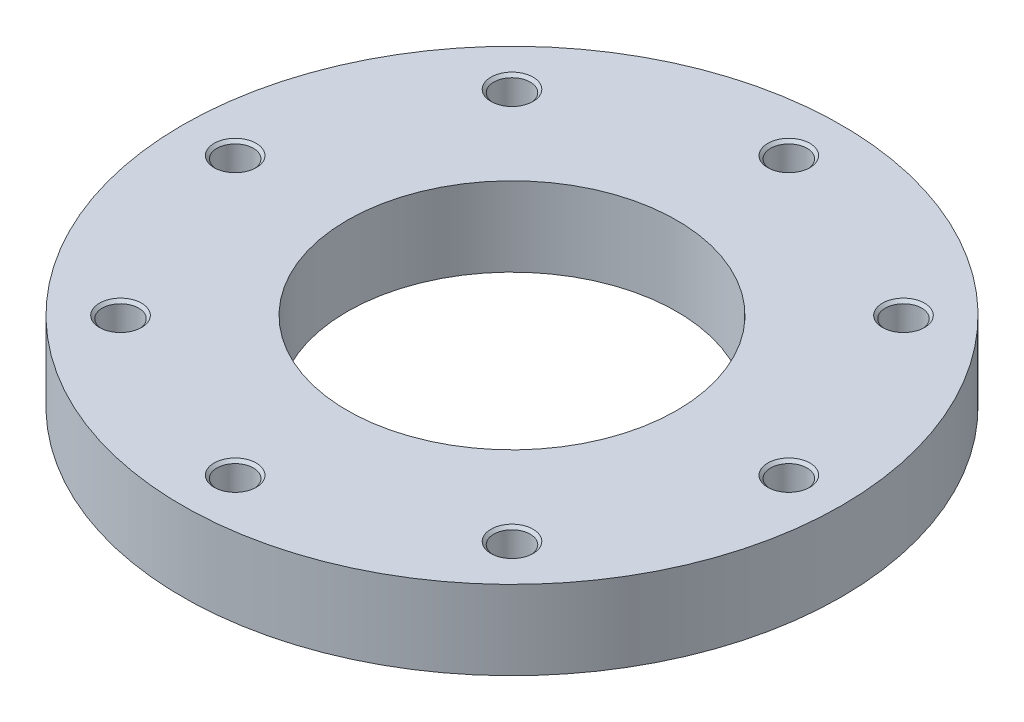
ISO-10303-21;
HEADER;
FILE_DESCRIPTION(('STEP AP214'),'2;1');
FILE_NAME('part.step','',(''),(''),'','','');
FILE_SCHEMA(('AUTOMOTIVE_DESIGN { 1 0 10303 214 1 1 1 1 }'));
ENDSEC;
DATA;
#1=APPLICATION_CONTEXT('core data for automotive mechanical design processes');
#2=APPLICATION_PROTOCOL_DEFINITION('international standard','automotive_design',2000,#1);
#3=PRODUCT_CONTEXT('',#1,'mechanical');
#4=PRODUCT('Part','Part','',(#3));
#5=PRODUCT_RELATED_PRODUCT_CATEGORY('part','',(#4));
#6=PRODUCT_DEFINITION_FORMATION('','',#4);
#7=PRODUCT_DEFINITION_CONTEXT('part definition',#1,'design');
#8=PRODUCT_DEFINITION('design','',#6,#7);
#9=PRODUCT_DEFINITION_SHAPE('','',#8);
#10=(LENGTH_UNIT() NAMED_UNIT(*) SI_UNIT(.MILLI.,.METRE.));
#11=(NAMED_UNIT(*) PLANE_ANGLE_UNIT() SI_UNIT($,.RADIAN.));
#12=(NAMED_UNIT(*) SI_UNIT($,.STERADIAN.) SOLID_ANGLE_UNIT());
#13=UNCERTAINTY_MEASURE_WITH_UNIT(LENGTH_MEASURE(1.E-05),#10,'distance_accuracy_value','');
#14=(GEOMETRIC_REPRESENTATION_CONTEXT(3) GLOBAL_UNCERTAINTY_ASSIGNED_CONTEXT((#13)) GLOBAL_UNIT_ASSIGNED_CONTEXT((#10,
#11,#12)) REPRESENTATION_CONTEXT('',''));
#15=CARTESIAN_POINT('',(0.,0.,0.));
#16=DIRECTION('',(0.,0.,1.));
#17=DIRECTION('',(1.,0.,0.));
#18=AXIS2_PLACEMENT_3D('',#15,#16,#17);
#19=CARTESIAN_POINT('',(0.,15.,0.));
#20=DIRECTION('',(0.,-1.,0.));
#21=DIRECTION('',(1.,0.,0.));
#22=AXIS2_PLACEMENT_3D('',#19,#20,#21);
#23=CYLINDRICAL_SURFACE('',#22,125.);
#24=CARTESIAN_POINT('',(0.,0.,0.));
#25=DIRECTION('',(0.,1.,0.));
#26=DIRECTION('',(1.,0.,0.));
#27=AXIS2_PLACEMENT_3D('',#24,#25,#26);
#28=CIRCLE('',#27,125.);
#29=CARTESIAN_POINT('',(125.,0.,0.));
#30=VERTEX_POINT('',#29);
#31=EDGE_CURVE('E9',#30,#30,#28,.T.);
#32=ORIENTED_EDGE('',*,*,#31,.T.);
#33=EDGE_LOOP('',(#32));
#34=FACE_BOUND('',#33,.T.);
#35=CARTESIAN_POINT('',(0.,30.,0.));
#36=DIRECTION('',(0.,1.,0.));
#37=DIRECTION('',(1.,0.,0.));
#38=AXIS2_PLACEMENT_3D('',#35,#36,#37);
#39=CIRCLE('',#38,125.);
#40=CARTESIAN_POINT('',(125.,30.,0.));
#41=VERTEX_POINT('',#40);
#42=EDGE_CURVE('E307',#41,#41,#39,.T.);
#43=ORIENTED_EDGE('',*,*,#42,.F.);
#44=EDGE_LOOP('',(#43));
#45=FACE_BOUND('',#44,.T.);
#46=ADVANCED_FACE('F15',(#34,#45),#23,.T.);
#47=CARTESIAN_POINT('',(93.75,0.,0.));
#48=DIRECTION('',(0.,-1.,0.));
#49=DIRECTION('',(-1.,0.,0.));
#50=AXIS2_PLACEMENT_3D('',#47,#48,#49);
#51=PLANE('',#50);
#52=CARTESIAN_POINT('',(0.,0.,0.));
#53=DIRECTION('',(0.,1.,0.));
#54=DIRECTION('',(1.,0.,0.));
#55=AXIS2_PLACEMENT_3D('',#52,#53,#54);
#56=CIRCLE('',#55,62.5);
#57=CARTESIAN_POINT('',(62.5,0.,0.));
#58=VERTEX_POINT('',#57);
#59=EDGE_CURVE('E22',#58,#58,#56,.T.);
#60=ORIENTED_EDGE('',*,*,#59,.T.);
#61=EDGE_LOOP('',(#60));
#62=FACE_BOUND('',#61,.T.);
#63=ORIENTED_EDGE('',*,*,#31,.F.);
#64=EDGE_LOOP('',(#63));
#65=FACE_BOUND('',#64,.T.);
#66=ADVANCED_FACE('F313',(#62,#65),#51,.T.);
#67=CARTESIAN_POINT('',(0.,15.,0.));
#68=DIRECTION('',(0.,-1.,0.));
#69=DIRECTION('',(1.,0.,0.));
#70=AXIS2_PLACEMENT_3D('',#67,#68,#69);
#71=CYLINDRICAL_SURFACE('',#70,62.5);
#72=CARTESIAN_POINT('',(0.,30.,0.));
#73=DIRECTION('',(0.,1.,0.));
#74=DIRECTION('',(1.,0.,0.));
#75=AXIS2_PLACEMENT_3D('',#72,#73,#74);
#76=CIRCLE('',#75,62.5);
#77=CARTESIAN_POINT('',(62.5,30.,0.));
#78=VERTEX_POINT('',#77);
#79=EDGE_CURVE('E283',#78,#78,#76,.T.);
#80=ORIENTED_EDGE('',*,*,#79,.T.);
#81=EDGE_LOOP('',(#80));
#82=FACE_BOUND('',#81,.T.);
#83=ORIENTED_EDGE('',*,*,#59,.F.);
#84=EDGE_LOOP('',(#83));
#85=FACE_BOUND('',#84,.T.);
#86=ADVANCED_FACE('F318',(#82,#85),#71,.F.);
#87=CARTESIAN_POINT('',(93.75,30.,0.));
#88=DIRECTION('',(0.,1.,0.));
#89=DIRECTION('',(1.,0.,0.));
#90=AXIS2_PLACEMENT_3D('',#87,#88,#89);
#91=PLANE('',#90);
#92=ORIENTED_EDGE('',*,*,#42,.T.);
#93=EDGE_LOOP('',(#92));
#94=FACE_BOUND('',#93,.T.);
#95=ORIENTED_EDGE('',*,*,#79,.F.);
#96=EDGE_LOOP('',(#95));
#97=FACE_BOUND('',#96,.T.);
#98=CARTESIAN_POINT('',(105.,30.,0.));
#99=DIRECTION('',(0.,-1.,0.));
#100=DIRECTION('',(1.,0.,0.));
#101=AXIS2_PLACEMENT_3D('',#98,#99,#100);
#102=CIRCLE('',#101,8.);
#103=CARTESIAN_POINT('',(113.,30.,0.));
#104=VERTEX_POINT('',#103);
#105=EDGE_CURVE('E274',#104,#104,#102,.T.);
#106=ORIENTED_EDGE('',*,*,#105,.T.);
#107=EDGE_LOOP('',(#106));
#108=FACE_BOUND('',#107,.T.);
#109=CARTESIAN_POINT('',(74.2462120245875,30.,-74.2462120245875));
#110=DIRECTION('',(0.,-1.,0.));
#111=DIRECTION('',(0.707106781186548,0.,-0.707106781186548));
#112=AXIS2_PLACEMENT_3D('',#109,#110,#111);
#113=CIRCLE('',#112,8.);
#114=CARTESIAN_POINT('',(79.9030662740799,30.,-79.9030662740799));
#115=VERTEX_POINT('',#114);
#116=EDGE_CURVE('E219',#115,#115,#113,.T.);
#117=ORIENTED_EDGE('',*,*,#116,.T.);
#118=EDGE_LOOP('',(#117));
#119=FACE_BOUND('',#118,.T.);
#120=CARTESIAN_POINT('',(0.,30.,-105.));
#121=DIRECTION('',(0.,-1.,0.));
#122=DIRECTION('',(0.,0.,-1.));
#123=AXIS2_PLACEMENT_3D('',#120,#121,#122);
#124=CIRCLE('',#123,8.);
#125=CARTESIAN_POINT('',(0.,30.,-113.));
#126=VERTEX_POINT('',#125);
#127=EDGE_CURVE('E245',#126,#126,#124,.T.);
#128=ORIENTED_EDGE('',*,*,#127,.T.);
#129=EDGE_LOOP('',(#128));
#130=FACE_BOUND('',#129,.T.);
#131=CARTESIAN_POINT('',(-74.2462120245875,30.,-74.2462120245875));
#132=DIRECTION('',(0.,-1.,0.));
#133=DIRECTION('',(-0.707106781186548,0.,-0.707106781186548));
#134=AXIS2_PLACEMENT_3D('',#131,#132,#133);
#135=CIRCLE('',#134,8.);
#136=CARTESIAN_POINT('',(-79.9030662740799,30.,-79.9030662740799));
#137=VERTEX_POINT('',#136);
#138=EDGE_CURVE('E273',#137,#137,#135,.T.);
#139=ORIENTED_EDGE('',*,*,#138,.T.);
#140=EDGE_LOOP('',(#139));
#141=FACE_BOUND('',#140,.T.);
#142=CARTESIAN_POINT('',(-105.,30.,0.));
#143=DIRECTION('',(0.,-1.,0.));
#144=DIRECTION('',(-1.,0.,0.));
#145=AXIS2_PLACEMENT_3D('',#142,#143,#144);
#146=CIRCLE('',#145,8.);
#147=CARTESIAN_POINT('',(-113.,30.,0.));
#148=VERTEX_POINT('',#147);
#149=EDGE_CURVE('E257',#148,#148,#146,.T.);
#150=ORIENTED_EDGE('',*,*,#149,.T.);
#151=EDGE_LOOP('',(#150));
#152=FACE_BOUND('',#151,.T.);
#153=CARTESIAN_POINT('',(-74.2462120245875,30.,74.2462120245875));
#154=DIRECTION('',(0.,-1.,0.));
#155=DIRECTION('',(-0.707106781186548,0.,0.707106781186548));
#156=AXIS2_PLACEMENT_3D('',#153,#154,#155);
#157=CIRCLE('',#156,8.);
#158=CARTESIAN_POINT('',(-79.9030662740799,30.,79.9030662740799));
#159=VERTEX_POINT('',#158);
#160=EDGE_CURVE('E228',#159,#159,#157,.T.);
#161=ORIENTED_EDGE('',*,*,#160,.T.);
#162=EDGE_LOOP('',(#161));
#163=FACE_BOUND('',#162,.T.);
#164=CARTESIAN_POINT('',(0.,30.,105.));
#165=DIRECTION('',(0.,-1.,0.));
#166=DIRECTION('',(0.,0.,1.));
#167=AXIS2_PLACEMENT_3D('',#164,#165,#166);
#168=CIRCLE('',#167,8.);
#169=CARTESIAN_POINT('',(0.,30.,113.));
#170=VERTEX_POINT('',#169);
#171=EDGE_CURVE('E205',#170,#170,#168,.T.);
#172=ORIENTED_EDGE('',*,*,#171,.T.);
#173=EDGE_LOOP('',(#172));
#174=FACE_BOUND('',#173,.T.);
#175=CARTESIAN_POINT('',(74.2462120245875,30.,74.2462120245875));
#176=DIRECTION('',(0.,-1.,0.));
#177=DIRECTION('',(0.707106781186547,0.,0.707106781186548));
#178=AXIS2_PLACEMENT_3D('',#175,#176,#177);
#179=CIRCLE('',#178,8.);
#180=CARTESIAN_POINT('',(79.9030662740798,30.,79.9030662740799));
#181=VERTEX_POINT('',#180);
#182=EDGE_CURVE('E225',#181,#181,#179,.T.);
#183=ORIENTED_EDGE('',*,*,#182,.T.);
#184=EDGE_LOOP('',(#183));
#185=FACE_BOUND('',#184,.T.);
#186=ADVANCED_FACE('F206',(#94,#97,#108,#119,#130,#141,#152,#163,#174,#185),#91,.T.);
#187=CARTESIAN_POINT('',(105.,5.00308975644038,0.));
#188=DIRECTION('',(0.,1.,0.));
#189=DIRECTION('',(1.,0.,0.));
#190=AXIS2_PLACEMENT_3D('',#187,#188,#189);
#191=CONICAL_SURFACE('',#190,3.45875,1.0471975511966);
#192=CARTESIAN_POINT('',(105.,7.,0.));
#193=DIRECTION('',(0.,-1.,0.));
#194=DIRECTION('',(1.,0.,0.));
#195=AXIS2_PLACEMENT_3D('',#192,#193,#194);
#196=CIRCLE('',#195,6.9175);
#197=CARTESIAN_POINT('',(111.9175,7.,0.));
#198=VERTEX_POINT('',#197);
#199=EDGE_CURVE('E281',#198,#198,#196,.T.);
#200=ORIENTED_EDGE('',*,*,#199,.F.);
#201=EDGE_LOOP('',(#200));
#202=FACE_BOUND('',#201,.T.);
#203=CARTESIAN_POINT('',(105.,3.00617951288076,0.));
#204=VERTEX_POINT('',#203);
#205=VERTEX_LOOP('',#204);
#206=FACE_BOUND('',#205,.T.);
#207=ADVANCED_FACE('F328',(#202,#206),#191,.F.);
#208=CARTESIAN_POINT('',(105.,9.95875,0.));
#209=DIRECTION('',(0.,1.,0.));
#210=DIRECTION('',(1.,0.,0.));
#211=AXIS2_PLACEMENT_3D('',#208,#209,#210);
#212=CYLINDRICAL_SURFACE('',#211,6.9175);
#213=CARTESIAN_POINT('',(105.,12.9175,0.));
#214=DIRECTION('',(0.,-1.,0.));
#215=DIRECTION('',(1.,0.,0.));
#216=AXIS2_PLACEMENT_3D('',#213,#214,#215);
#217=CIRCLE('',#216,6.9175);
#218=CARTESIAN_POINT('',(111.9175,12.9175,0.));
#219=VERTEX_POINT('',#218);
#220=EDGE_CURVE('E284',#219,#219,#217,.T.);
#221=ORIENTED_EDGE('',*,*,#220,.F.);
#222=EDGE_LOOP('',(#221));
#223=FACE_BOUND('',#222,.T.);
#224=ORIENTED_EDGE('',*,*,#199,.T.);
#225=EDGE_LOOP('',(#224));
#226=FACE_BOUND('',#225,.T.);
#227=ADVANCED_FACE('F331',(#223,#226),#212,.F.);
#228=CARTESIAN_POINT('',(105.,13.45875,0.));
#229=DIRECTION('',(0.,1.,0.));
#230=DIRECTION('',(1.,0.,0.));
#231=AXIS2_PLACEMENT_3D('',#228,#229,#230);
#232=CONICAL_SURFACE('',#231,7.45875,0.785398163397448);
#233=CARTESIAN_POINT('',(105.,14.,0.));
#234=DIRECTION('',(0.,-1.,0.));
#235=DIRECTION('',(1.,0.,0.));
#236=AXIS2_PLACEMENT_3D('',#233,#234,#235);
#237=CIRCLE('',#236,8.);
#238=CARTESIAN_POINT('',(113.,14.,0.));
#239=VERTEX_POINT('',#238);
#240=EDGE_CURVE('E303',#239,#239,#237,.T.);
#241=ORIENTED_EDGE('',*,*,#240,.F.);
#242=EDGE_LOOP('',(#241));
#243=FACE_BOUND('',#242,.T.);
#244=ORIENTED_EDGE('',*,*,#220,.T.);
#245=EDGE_LOOP('',(#244));
#246=FACE_BOUND('',#245,.T.);
#247=ADVANCED_FACE('F333',(#243,#246),#232,.F.);
#248=CARTESIAN_POINT('',(112.45875,14.,0.));
#249=DIRECTION('',(0.,1.,0.));
#250=DIRECTION('',(-1.,0.,0.));
#251=AXIS2_PLACEMENT_3D('',#248,#249,#250);
#252=PLANE('',#251);
#253=CARTESIAN_POINT('',(105.,14.,0.));
#254=DIRECTION('',(0.,-1.,0.));
#255=DIRECTION('',(1.,0.,0.));
#256=AXIS2_PLACEMENT_3D('',#253,#254,#255);
#257=CIRCLE('',#256,6.9175);
#258=CARTESIAN_POINT('',(111.9175,14.,0.));
#259=VERTEX_POINT('',#258);
#260=EDGE_CURVE('E276',#259,#259,#257,.T.);
#261=ORIENTED_EDGE('',*,*,#260,.F.);
#262=EDGE_LOOP('',(#261));
#263=FACE_BOUND('',#262,.T.);
#264=ORIENTED_EDGE('',*,*,#240,.T.);
#265=EDGE_LOOP('',(#264));
#266=FACE_BOUND('',#265,.T.);
#267=ADVANCED_FACE('F336',(#263,#266),#252,.F.);
#268=CARTESIAN_POINT('',(105.,21.45875,0.));
#269=DIRECTION('',(0.,1.,0.));
#270=DIRECTION('',(1.,0.,0.));
#271=AXIS2_PLACEMENT_3D('',#268,#269,#270);
#272=CYLINDRICAL_SURFACE('',#271,6.9175);
#273=CARTESIAN_POINT('',(105.,28.9175,0.));
#274=DIRECTION('',(0.,-1.,0.));
#275=DIRECTION('',(1.,0.,0.));
#276=AXIS2_PLACEMENT_3D('',#273,#274,#275);
#277=CIRCLE('',#276,6.9175);
#278=CARTESIAN_POINT('',(111.9175,28.9175,0.));
#279=VERTEX_POINT('',#278);
#280=EDGE_CURVE('E268',#279,#279,#277,.T.);
#281=ORIENTED_EDGE('',*,*,#280,.F.);
#282=EDGE_LOOP('',(#281));
#283=FACE_BOUND('',#282,.T.);
#284=ORIENTED_EDGE('',*,*,#260,.T.);
#285=EDGE_LOOP('',(#284));
#286=FACE_BOUND('',#285,.T.);
#287=ADVANCED_FACE('F340',(#283,#286),#272,.F.);
#288=CARTESIAN_POINT('',(105.,29.45875,0.));
#289=DIRECTION('',(0.,1.,0.));
#290=DIRECTION('',(1.,0.,0.));
#291=AXIS2_PLACEMENT_3D('',#288,#289,#290);
#292=CONICAL_SURFACE('',#291,7.45875,0.785398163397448);
#293=ORIENTED_EDGE('',*,*,#105,.F.);
#294=EDGE_LOOP('',(#293));
#295=FACE_BOUND('',#294,.T.);
#296=ORIENTED_EDGE('',*,*,#280,.T.);
#297=EDGE_LOOP('',(#296));
#298=FACE_BOUND('',#297,.T.);
#299=ADVANCED_FACE('F344',(#295,#298),#292,.F.);
#300=CARTESIAN_POINT('',(74.2462120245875,5.00308975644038,-74.2462120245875));
#301=DIRECTION('',(0.,1.,0.));
#302=DIRECTION('',(0.707106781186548,0.,-0.707106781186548));
#303=AXIS2_PLACEMENT_3D('',#300,#301,#302);
#304=CONICAL_SURFACE('',#303,3.45875,1.0471975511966);
#305=CARTESIAN_POINT('',(74.2462120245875,7.,-74.2462120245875));
#306=DIRECTION('',(0.,-1.,0.));
#307=DIRECTION('',(0.707106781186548,0.,-0.707106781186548));
#308=AXIS2_PLACEMENT_3D('',#305,#306,#307);
#309=CIRCLE('',#308,6.9175);
#310=CARTESIAN_POINT('',(79.1376231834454,7.,-79.1376231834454));
#311=VERTEX_POINT('',#310);
#312=EDGE_CURVE('E266',#311,#311,#309,.T.);
#313=ORIENTED_EDGE('',*,*,#312,.F.);
#314=EDGE_LOOP('',(#313));
#315=FACE_BOUND('',#314,.T.);
#316=CARTESIAN_POINT('',(74.2462120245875,3.00617951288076,-74.2462120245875));
#317=VERTEX_POINT('',#316);
#318=VERTEX_LOOP('',#317);
#319=FACE_BOUND('',#318,.T.);
#320=ADVANCED_FACE('F346',(#315,#319),#304,.F.);
#321=CARTESIAN_POINT('',(74.2462120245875,9.95875,-74.2462120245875));
#322=DIRECTION('',(0.,1.,0.));
#323=DIRECTION('',(0.707106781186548,0.,-0.707106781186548));
#324=AXIS2_PLACEMENT_3D('',#321,#322,#323);
#325=CYLINDRICAL_SURFACE('',#324,6.9175);
#326=CARTESIAN_POINT('',(74.2462120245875,12.9175,-74.2462120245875));
#327=DIRECTION('',(0.,-1.,0.));
#328=DIRECTION('',(0.707106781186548,0.,-0.707106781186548));
#329=AXIS2_PLACEMENT_3D('',#326,#327,#328);
#330=CIRCLE('',#329,6.9175);
#331=CARTESIAN_POINT('',(79.1376231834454,12.9175,-79.1376231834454));
#332=VERTEX_POINT('',#331);
#333=EDGE_CURVE('E269',#332,#332,#330,.T.);
#334=ORIENTED_EDGE('',*,*,#333,.F.);
#335=EDGE_LOOP('',(#334));
#336=FACE_BOUND('',#335,.T.);
#337=ORIENTED_EDGE('',*,*,#312,.T.);
#338=EDGE_LOOP('',(#337));
#339=FACE_BOUND('',#338,.T.);
#340=ADVANCED_FACE('F349',(#336,#339),#325,.F.);
#341=CARTESIAN_POINT('',(74.2462120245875,13.45875,-74.2462120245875));
#342=DIRECTION('',(0.,1.,0.));
#343=DIRECTION('',(0.707106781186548,0.,-0.707106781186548));
#344=AXIS2_PLACEMENT_3D('',#341,#342,#343);
#345=CONICAL_SURFACE('',#344,7.45875,0.785398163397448);
#346=CARTESIAN_POINT('',(74.2462120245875,14.,-74.2462120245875));
#347=DIRECTION('',(0.,-1.,0.));
#348=DIRECTION('',(0.707106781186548,0.,-0.707106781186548));
#349=AXIS2_PLACEMENT_3D('',#346,#347,#348);
#350=CIRCLE('',#349,8.);
#351=CARTESIAN_POINT('',(79.9030662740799,14.,-79.9030662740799));
#352=VERTEX_POINT('',#351);
#353=EDGE_CURVE('E298',#352,#352,#350,.T.);
#354=ORIENTED_EDGE('',*,*,#353,.F.);
#355=EDGE_LOOP('',(#354));
#356=FACE_BOUND('',#355,.T.);
#357=ORIENTED_EDGE('',*,*,#333,.T.);
#358=EDGE_LOOP('',(#357));
#359=FACE_BOUND('',#358,.T.);
#360=ADVANCED_FACE('F353',(#356,#359),#345,.F.);
#361=CARTESIAN_POINT('',(79.5203447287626,14.,-79.5203447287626));
#362=DIRECTION('',(0.,1.,0.));
#363=DIRECTION('',(-0.707106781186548,0.,0.707106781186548));
#364=AXIS2_PLACEMENT_3D('',#361,#362,#363);
#365=PLANE('',#364);
#366=CARTESIAN_POINT('',(74.2462120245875,14.,-74.2462120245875));
#367=DIRECTION('',(0.,-1.,0.));
#368=DIRECTION('',(0.707106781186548,0.,-0.707106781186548));
#369=AXIS2_PLACEMENT_3D('',#366,#367,#368);
#370=CIRCLE('',#369,6.9175);
#371=CARTESIAN_POINT('',(79.1376231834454,14.,-79.1376231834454));
#372=VERTEX_POINT('',#371);
#373=EDGE_CURVE('E221',#372,#372,#370,.T.);
#374=ORIENTED_EDGE('',*,*,#373,.F.);
#375=EDGE_LOOP('',(#374));
#376=FACE_BOUND('',#375,.T.);
#377=ORIENTED_EDGE('',*,*,#353,.T.);
#378=EDGE_LOOP('',(#377));
#379=FACE_BOUND('',#378,.T.);
#380=ADVANCED_FACE('F357',(#376,#379),#365,.F.);
#381=CARTESIAN_POINT('',(74.2462120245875,21.45875,-74.2462120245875));
#382=DIRECTION('',(0.,1.,0.));
#383=DIRECTION('',(0.707106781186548,0.,-0.707106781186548));
#384=AXIS2_PLACEMENT_3D('',#381,#382,#383);
#385=CYLINDRICAL_SURFACE('',#384,6.9175);
#386=CARTESIAN_POINT('',(74.2462120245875,28.9175,-74.2462120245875));
#387=DIRECTION('',(0.,-1.,0.));
#388=DIRECTION('',(0.707106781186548,0.,-0.707106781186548));
#389=AXIS2_PLACEMENT_3D('',#386,#387,#388);
#390=CIRCLE('',#389,6.9175);
#391=CARTESIAN_POINT('',(79.1376231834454,28.9175,-79.1376231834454));
#392=VERTEX_POINT('',#391);
#393=EDGE_CURVE('E222',#392,#392,#390,.T.);
#394=ORIENTED_EDGE('',*,*,#393,.F.);
#395=EDGE_LOOP('',(#394));
#396=FACE_BOUND('',#395,.T.);
#397=ORIENTED_EDGE('',*,*,#373,.T.);
#398=EDGE_LOOP('',(#397));
#399=FACE_BOUND('',#398,.T.);
#400=ADVANCED_FACE('F361',(#396,#399),#385,.F.);
#401=CARTESIAN_POINT('',(74.2462120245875,29.45875,-74.2462120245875));
#402=DIRECTION('',(0.,1.,0.));
#403=DIRECTION('',(0.707106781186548,0.,-0.707106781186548));
#404=AXIS2_PLACEMENT_3D('',#401,#402,#403);
#405=CONICAL_SURFACE('',#404,7.45875,0.785398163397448);
#406=ORIENTED_EDGE('',*,*,#116,.F.);
#407=EDGE_LOOP('',(#406));
#408=FACE_BOUND('',#407,.T.);
#409=ORIENTED_EDGE('',*,*,#393,.T.);
#410=EDGE_LOOP('',(#409));
#411=FACE_BOUND('',#410,.T.);
#412=ADVANCED_FACE('F363',(#408,#411),#405,.F.);
#413=CARTESIAN_POINT('',(0.,5.00308975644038,-105.));
#414=DIRECTION('',(0.,1.,0.));
#415=DIRECTION('',(0.,0.,-1.));
#416=AXIS2_PLACEMENT_3D('',#413,#414,#415);
#417=CONICAL_SURFACE('',#416,3.45875,1.0471975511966);
#418=CARTESIAN_POINT('',(0.,7.,-105.));
#419=DIRECTION('',(0.,-1.,0.));
#420=DIRECTION('',(0.,0.,-1.));
#421=AXIS2_PLACEMENT_3D('',#418,#419,#420);
#422=CIRCLE('',#421,6.9175);
#423=CARTESIAN_POINT('',(0.,7.,-111.9175));
#424=VERTEX_POINT('',#423);
#425=EDGE_CURVE('E255',#424,#424,#422,.T.);
#426=ORIENTED_EDGE('',*,*,#425,.F.);
#427=EDGE_LOOP('',(#426));
#428=FACE_BOUND('',#427,.T.);
#429=CARTESIAN_POINT('',(0.,3.00617951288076,-105.));
#430=VERTEX_POINT('',#429);
#431=VERTEX_LOOP('',#430);
#432=FACE_BOUND('',#431,.T.);
#433=ADVANCED_FACE('F366',(#428,#432),#417,.F.);
#434=CARTESIAN_POINT('',(0.,9.95875,-105.));
#435=DIRECTION('',(0.,1.,0.));
#436=DIRECTION('',(0.,0.,-1.));
#437=AXIS2_PLACEMENT_3D('',#434,#435,#436);
#438=CYLINDRICAL_SURFACE('',#437,6.9175);
#439=CARTESIAN_POINT('',(0.,12.9175,-105.));
#440=DIRECTION('',(0.,-1.,0.));
#441=DIRECTION('',(0.,0.,-1.));
#442=AXIS2_PLACEMENT_3D('',#439,#440,#441);
#443=CIRCLE('',#442,6.9175);
#444=CARTESIAN_POINT('',(0.,12.9175,-111.9175));
#445=VERTEX_POINT('',#444);
#446=EDGE_CURVE('E294',#445,#445,#443,.T.);
#447=ORIENTED_EDGE('',*,*,#446,.F.);
#448=EDGE_LOOP('',(#447));
#449=FACE_BOUND('',#448,.T.);
#450=ORIENTED_EDGE('',*,*,#425,.T.);
#451=EDGE_LOOP('',(#450));
#452=FACE_BOUND('',#451,.T.);
#453=ADVANCED_FACE('F370',(#449,#452),#438,.F.);
#454=CARTESIAN_POINT('',(0.,13.45875,-105.));
#455=DIRECTION('',(0.,1.,0.));
#456=DIRECTION('',(0.,0.,-1.));
#457=AXIS2_PLACEMENT_3D('',#454,#455,#456);
#458=CONICAL_SURFACE('',#457,7.45875,0.785398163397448);
#459=CARTESIAN_POINT('',(0.,14.,-105.));
#460=DIRECTION('',(0.,-1.,0.));
#461=DIRECTION('',(0.,0.,-1.));
#462=AXIS2_PLACEMENT_3D('',#459,#460,#461);
#463=CIRCLE('',#462,8.);
#464=CARTESIAN_POINT('',(0.,14.,-113.));
#465=VERTEX_POINT('',#464);
#466=EDGE_CURVE('E244',#465,#465,#463,.T.);
#467=ORIENTED_EDGE('',*,*,#466,.F.);
#468=EDGE_LOOP('',(#467));
#469=FACE_BOUND('',#468,.T.);
#470=ORIENTED_EDGE('',*,*,#446,.T.);
#471=EDGE_LOOP('',(#470));
#472=FACE_BOUND('',#471,.T.);
#473=ADVANCED_FACE('F374',(#469,#472),#458,.F.);
#474=CARTESIAN_POINT('',(0.,14.,-112.45875));
#475=DIRECTION('',(0.,1.,0.));
#476=DIRECTION('',(0.,0.,1.));
#477=AXIS2_PLACEMENT_3D('',#474,#475,#476);
#478=PLANE('',#477);
#479=CARTESIAN_POINT('',(0.,14.,-105.));
#480=DIRECTION('',(0.,-1.,0.));
#481=DIRECTION('',(0.,0.,-1.));
#482=AXIS2_PLACEMENT_3D('',#479,#480,#481);
#483=CIRCLE('',#482,6.9175);
#484=CARTESIAN_POINT('',(0.,14.,-111.9175));
#485=VERTEX_POINT('',#484);
#486=EDGE_CURVE('E242',#485,#485,#483,.T.);
#487=ORIENTED_EDGE('',*,*,#486,.F.);
#488=EDGE_LOOP('',(#487));
#489=FACE_BOUND('',#488,.T.);
#490=ORIENTED_EDGE('',*,*,#466,.T.);
#491=EDGE_LOOP('',(#490));
#492=FACE_BOUND('',#491,.T.);
#493=ADVANCED_FACE('F376',(#489,#492),#478,.F.);
#494=CARTESIAN_POINT('',(0.,21.45875,-105.));
#495=DIRECTION('',(0.,1.,0.));
#496=DIRECTION('',(0.,0.,-1.));
#497=AXIS2_PLACEMENT_3D('',#494,#495,#496);
#498=CYLINDRICAL_SURFACE('',#497,6.9175);
#499=CARTESIAN_POINT('',(0.,28.9175,-105.));
#500=DIRECTION('',(0.,-1.,0.));
#501=DIRECTION('',(0.,0.,-1.));
#502=AXIS2_PLACEMENT_3D('',#499,#500,#501);
#503=CIRCLE('',#502,6.9175);
#504=CARTESIAN_POINT('',(0.,28.9175,-111.9175));
#505=VERTEX_POINT('',#504);
#506=EDGE_CURVE('E290',#505,#505,#503,.T.);
#507=ORIENTED_EDGE('',*,*,#506,.F.);
#508=EDGE_LOOP('',(#507));
#509=FACE_BOUND('',#508,.T.);
#510=ORIENTED_EDGE('',*,*,#486,.T.);
#511=EDGE_LOOP('',(#510));
#512=FACE_BOUND('',#511,.T.);
#513=ADVANCED_FACE('F379',(#509,#512),#498,.F.);
#514=CARTESIAN_POINT('',(0.,29.45875,-105.));
#515=DIRECTION('',(0.,1.,0.));
#516=DIRECTION('',(0.,0.,-1.));
#517=AXIS2_PLACEMENT_3D('',#514,#515,#516);
#518=CONICAL_SURFACE('',#517,7.45875,0.785398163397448);
#519=ORIENTED_EDGE('',*,*,#127,.F.);
#520=EDGE_LOOP('',(#519));
#521=FACE_BOUND('',#520,.T.);
#522=ORIENTED_EDGE('',*,*,#506,.T.);
#523=EDGE_LOOP('',(#522));
#524=FACE_BOUND('',#523,.T.);
#525=ADVANCED_FACE('F383',(#521,#524),#518,.F.);
#526=CARTESIAN_POINT('',(-74.2462120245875,5.00308975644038,-74.2462120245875));
#527=DIRECTION('',(0.,1.,0.));
#528=DIRECTION('',(-0.707106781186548,0.,-0.707106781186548));
#529=AXIS2_PLACEMENT_3D('',#526,#527,#528);
#530=CONICAL_SURFACE('',#529,3.45875,1.0471975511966);
#531=CARTESIAN_POINT('',(-74.2462120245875,7.,-74.2462120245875));
#532=DIRECTION('',(0.,-1.,0.));
#533=DIRECTION('',(-0.707106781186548,0.,-0.707106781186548));
#534=AXIS2_PLACEMENT_3D('',#531,#532,#533);
#535=CIRCLE('',#534,6.9175);
#536=CARTESIAN_POINT('',(-79.1376231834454,7.,-79.1376231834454));
#537=VERTEX_POINT('',#536);
#538=EDGE_CURVE('E288',#537,#537,#535,.T.);
#539=ORIENTED_EDGE('',*,*,#538,.F.);
#540=EDGE_LOOP('',(#539));
#541=FACE_BOUND('',#540,.T.);
#542=CARTESIAN_POINT('',(-74.2462120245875,3.00617951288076,-74.2462120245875));
#543=VERTEX_POINT('',#542);
#544=VERTEX_LOOP('',#543);
#545=FACE_BOUND('',#544,.T.);
#546=ADVANCED_FACE('F387',(#541,#545),#530,.F.);
#547=CARTESIAN_POINT('',(-74.2462120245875,9.95875,-74.2462120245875));
#548=DIRECTION('',(0.,1.,0.));
#549=DIRECTION('',(-0.707106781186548,0.,-0.707106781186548));
#550=AXIS2_PLACEMENT_3D('',#547,#548,#549);
#551=CYLINDRICAL_SURFACE('',#550,6.9175);
#552=CARTESIAN_POINT('',(-74.2462120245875,12.9175,-74.2462120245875));
#553=DIRECTION('',(0.,-1.,0.));
#554=DIRECTION('',(-0.707106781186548,0.,-0.707106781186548));
#555=AXIS2_PLACEMENT_3D('',#552,#553,#554);
#556=CIRCLE('',#555,6.9175);
#557=CARTESIAN_POINT('',(-79.1376231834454,12.9175,-79.1376231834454));
#558=VERTEX_POINT('',#557);
#559=EDGE_CURVE('E286',#558,#558,#556,.T.);
#560=ORIENTED_EDGE('',*,*,#559,.F.);
#561=EDGE_LOOP('',(#560));
#562=FACE_BOUND('',#561,.T.);
#563=ORIENTED_EDGE('',*,*,#538,.T.);
#564=EDGE_LOOP('',(#563));
#565=FACE_BOUND('',#564,.T.);
#566=ADVANCED_FACE('F391',(#562,#565),#551,.F.);
#567=CARTESIAN_POINT('',(-74.2462120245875,13.45875,-74.2462120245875));
#568=DIRECTION('',(0.,1.,0.));
#569=DIRECTION('',(-0.707106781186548,0.,-0.707106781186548));
#570=AXIS2_PLACEMENT_3D('',#567,#568,#569);
#571=CONICAL_SURFACE('',#570,7.45875,0.785398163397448);
#572=CARTESIAN_POINT('',(-74.2462120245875,14.,-74.2462120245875));
#573=DIRECTION('',(0.,-1.,0.));
#574=DIRECTION('',(-0.707106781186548,0.,-0.707106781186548));
#575=AXIS2_PLACEMENT_3D('',#572,#573,#574);
#576=CIRCLE('',#575,8.);
#577=CARTESIAN_POINT('',(-79.9030662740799,14.,-79.9030662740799));
#578=VERTEX_POINT('',#577);
#579=EDGE_CURVE('E280',#578,#578,#576,.T.);
#580=ORIENTED_EDGE('',*,*,#579,.F.);
#581=EDGE_LOOP('',(#580));
#582=FACE_BOUND('',#581,.T.);
#583=ORIENTED_EDGE('',*,*,#559,.T.);
#584=EDGE_LOOP('',(#583));
#585=FACE_BOUND('',#584,.T.);
#586=ADVANCED_FACE('F395',(#582,#585),#571,.F.);
#587=CARTESIAN_POINT('',(-79.5203447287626,14.,-79.5203447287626));
#588=DIRECTION('',(0.,1.,0.));
#589=DIRECTION('',(0.707106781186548,0.,0.707106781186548));
#590=AXIS2_PLACEMENT_3D('',#587,#588,#589);
#591=PLANE('',#590);
#592=CARTESIAN_POINT('',(-74.2462120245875,14.,-74.2462120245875));
#593=DIRECTION('',(0.,-1.,0.));
#594=DIRECTION('',(-0.707106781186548,0.,-0.707106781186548));
#595=AXIS2_PLACEMENT_3D('',#592,#593,#594);
#596=CIRCLE('',#595,6.9175);
#597=CARTESIAN_POINT('',(-79.1376231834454,14.,-79.1376231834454));
#598=VERTEX_POINT('',#597);
#599=EDGE_CURVE('E278',#598,#598,#596,.T.);
#600=ORIENTED_EDGE('',*,*,#599,.F.);
#601=EDGE_LOOP('',(#600));
#602=FACE_BOUND('',#601,.T.);
#603=ORIENTED_EDGE('',*,*,#579,.T.);
#604=EDGE_LOOP('',(#603));
#605=FACE_BOUND('',#604,.T.);
#606=ADVANCED_FACE('F402',(#602,#605),#591,.F.);
#607=CARTESIAN_POINT('',(-74.2462120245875,21.45875,-74.2462120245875));
#608=DIRECTION('',(0.,1.,0.));
#609=DIRECTION('',(-0.707106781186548,0.,-0.707106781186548));
#610=AXIS2_PLACEMENT_3D('',#607,#608,#609);
#611=CYLINDRICAL_SURFACE('',#610,6.9175);
#612=CARTESIAN_POINT('',(-74.2462120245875,28.9175,-74.2462120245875));
#613=DIRECTION('',(0.,-1.,0.));
#614=DIRECTION('',(-0.707106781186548,0.,-0.707106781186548));
#615=AXIS2_PLACEMENT_3D('',#612,#613,#614);
#616=CIRCLE('',#615,6.9175);
#617=CARTESIAN_POINT('',(-79.1376231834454,28.9175,-79.1376231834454));
#618=VERTEX_POINT('',#617);
#619=EDGE_CURVE('E271',#618,#618,#616,.T.);
#620=ORIENTED_EDGE('',*,*,#619,.F.);
#621=EDGE_LOOP('',(#620));
#622=FACE_BOUND('',#621,.T.);
#623=ORIENTED_EDGE('',*,*,#599,.T.);
#624=EDGE_LOOP('',(#623));
#625=FACE_BOUND('',#624,.T.);
#626=ADVANCED_FACE('F406',(#622,#625),#611,.F.);
#627=CARTESIAN_POINT('',(-74.2462120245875,29.45875,-74.2462120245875));
#628=DIRECTION('',(0.,1.,0.));
#629=DIRECTION('',(-0.707106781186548,0.,-0.707106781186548));
#630=AXIS2_PLACEMENT_3D('',#627,#628,#629);
#631=CONICAL_SURFACE('',#630,7.45875,0.785398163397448);
#632=ORIENTED_EDGE('',*,*,#138,.F.);
#633=EDGE_LOOP('',(#632));
#634=FACE_BOUND('',#633,.T.);
#635=ORIENTED_EDGE('',*,*,#619,.T.);
#636=EDGE_LOOP('',(#635));
#637=FACE_BOUND('',#636,.T.);
#638=ADVANCED_FACE('F410',(#634,#637),#631,.F.);
#639=CARTESIAN_POINT('',(-105.,5.00308975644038,0.));
#640=DIRECTION('',(0.,1.,0.));
#641=DIRECTION('',(-1.,0.,0.));
#642=AXIS2_PLACEMENT_3D('',#639,#640,#641);
#643=CONICAL_SURFACE('',#642,3.45875,1.0471975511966);
#644=CARTESIAN_POINT('',(-105.,7.,0.));
#645=DIRECTION('',(0.,-1.,0.));
#646=DIRECTION('',(-1.,0.,0.));
#647=AXIS2_PLACEMENT_3D('',#644,#645,#646);
#648=CIRCLE('',#647,6.9175);
#649=CARTESIAN_POINT('',(-111.9175,7.,0.));
#650=VERTEX_POINT('',#649);
#651=EDGE_CURVE('E265',#650,#650,#648,.T.);
#652=ORIENTED_EDGE('',*,*,#651,.F.);
#653=EDGE_LOOP('',(#652));
#654=FACE_BOUND('',#653,.T.);
#655=CARTESIAN_POINT('',(-105.,3.00617951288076,0.));
#656=VERTEX_POINT('',#655);
#657=VERTEX_LOOP('',#656);
#658=FACE_BOUND('',#657,.T.);
#659=ADVANCED_FACE('F414',(#654,#658),#643,.F.);
#660=CARTESIAN_POINT('',(-105.,9.95875,0.));
#661=DIRECTION('',(0.,1.,0.));
#662=DIRECTION('',(-1.,0.,0.));
#663=AXIS2_PLACEMENT_3D('',#660,#661,#662);
#664=CYLINDRICAL_SURFACE('',#663,6.9175);
#665=CARTESIAN_POINT('',(-105.,12.9175,0.));
#666=DIRECTION('',(0.,-1.,0.));
#667=DIRECTION('',(-1.,0.,0.));
#668=AXIS2_PLACEMENT_3D('',#665,#666,#667);
#669=CIRCLE('',#668,6.9175);
#670=CARTESIAN_POINT('',(-111.9175,12.9175,0.));
#671=VERTEX_POINT('',#670);
#672=EDGE_CURVE('E263',#671,#671,#669,.T.);
#673=ORIENTED_EDGE('',*,*,#672,.F.);
#674=EDGE_LOOP('',(#673));
#675=FACE_BOUND('',#674,.T.);
#676=ORIENTED_EDGE('',*,*,#651,.T.);
#677=EDGE_LOOP('',(#676));
#678=FACE_BOUND('',#677,.T.);
#679=ADVANCED_FACE('F421',(#675,#678),#664,.F.);
#680=CARTESIAN_POINT('',(-105.,13.45875,0.));
#681=DIRECTION('',(0.,1.,0.));
#682=DIRECTION('',(-1.,0.,0.));
#683=AXIS2_PLACEMENT_3D('',#680,#681,#682);
#684=CONICAL_SURFACE('',#683,7.45875,0.785398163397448);
#685=CARTESIAN_POINT('',(-105.,14.,0.));
#686=DIRECTION('',(0.,-1.,0.));
#687=DIRECTION('',(-1.,0.,0.));
#688=AXIS2_PLACEMENT_3D('',#685,#686,#687);
#689=CIRCLE('',#688,8.);
#690=CARTESIAN_POINT('',(-113.,14.,0.));
#691=VERTEX_POINT('',#690);
#692=EDGE_CURVE('E261',#691,#691,#689,.T.);
#693=ORIENTED_EDGE('',*,*,#692,.F.);
#694=EDGE_LOOP('',(#693));
#695=FACE_BOUND('',#694,.T.);
#696=ORIENTED_EDGE('',*,*,#672,.T.);
#697=EDGE_LOOP('',(#696));
#698=FACE_BOUND('',#697,.T.);
#699=ADVANCED_FACE('F425',(#695,#698),#684,.F.);
#700=CARTESIAN_POINT('',(-112.45875,14.,0.));
#701=DIRECTION('',(0.,1.,0.));
#702=DIRECTION('',(1.,0.,0.));
#703=AXIS2_PLACEMENT_3D('',#700,#701,#702);
#704=PLANE('',#703);
#705=CARTESIAN_POINT('',(-105.,14.,0.));
#706=DIRECTION('',(0.,-1.,0.));
#707=DIRECTION('',(-1.,0.,0.));
#708=AXIS2_PLACEMENT_3D('',#705,#706,#707);
#709=CIRCLE('',#708,6.9175);
#710=CARTESIAN_POINT('',(-111.9175,14.,0.));
#711=VERTEX_POINT('',#710);
#712=EDGE_CURVE('E259',#711,#711,#709,.T.);
#713=ORIENTED_EDGE('',*,*,#712,.F.);
#714=EDGE_LOOP('',(#713));
#715=FACE_BOUND('',#714,.T.);
#716=ORIENTED_EDGE('',*,*,#692,.T.);
#717=EDGE_LOOP('',(#716));
#718=FACE_BOUND('',#717,.T.);
#719=ADVANCED_FACE('F429',(#715,#718),#704,.F.);
#720=CARTESIAN_POINT('',(-105.,21.45875,0.));
#721=DIRECTION('',(0.,1.,0.));
#722=DIRECTION('',(-1.,0.,0.));
#723=AXIS2_PLACEMENT_3D('',#720,#721,#722);
#724=CYLINDRICAL_SURFACE('',#723,6.9175);
#725=CARTESIAN_POINT('',(-105.,28.9175,0.));
#726=DIRECTION('',(0.,-1.,0.));
#727=DIRECTION('',(-1.,0.,0.));
#728=AXIS2_PLACEMENT_3D('',#725,#726,#727);
#729=CIRCLE('',#728,6.9175);
#730=CARTESIAN_POINT('',(-111.9175,28.9175,0.));
#731=VERTEX_POINT('',#730);
#732=EDGE_CURVE('E253',#731,#731,#729,.T.);
#733=ORIENTED_EDGE('',*,*,#732,.F.);
#734=EDGE_LOOP('',(#733));
#735=FACE_BOUND('',#734,.T.);
#736=ORIENTED_EDGE('',*,*,#712,.T.);
#737=EDGE_LOOP('',(#736));
#738=FACE_BOUND('',#737,.T.);
#739=ADVANCED_FACE('F433',(#735,#738),#724,.F.);
#740=CARTESIAN_POINT('',(-105.,29.45875,0.));
#741=DIRECTION('',(0.,1.,0.));
#742=DIRECTION('',(-1.,0.,0.));
#743=AXIS2_PLACEMENT_3D('',#740,#741,#742);
#744=CONICAL_SURFACE('',#743,7.45875,0.785398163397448);
#745=ORIENTED_EDGE('',*,*,#149,.F.);
#746=EDGE_LOOP('',(#745));
#747=FACE_BOUND('',#746,.T.);
#748=ORIENTED_EDGE('',*,*,#732,.T.);
#749=EDGE_LOOP('',(#748));
#750=FACE_BOUND('',#749,.T.);
#751=ADVANCED_FACE('F437',(#747,#750),#744,.F.);
#752=CARTESIAN_POINT('',(-74.2462120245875,5.00308975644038,74.2462120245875));
#753=DIRECTION('',(0.,1.,0.));
#754=DIRECTION('',(-0.707106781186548,0.,0.707106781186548));
#755=AXIS2_PLACEMENT_3D('',#752,#753,#754);
#756=CONICAL_SURFACE('',#755,3.45875,1.0471975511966);
#757=CARTESIAN_POINT('',(-74.2462120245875,7.,74.2462120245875));
#758=DIRECTION('',(0.,-1.,0.));
#759=DIRECTION('',(-0.707106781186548,0.,0.707106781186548));
#760=AXIS2_PLACEMENT_3D('',#757,#758,#759);
#761=CIRCLE('',#760,6.9175);
#762=CARTESIAN_POINT('',(-79.1376231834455,7.,79.1376231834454));
#763=VERTEX_POINT('',#762);
#764=EDGE_CURVE('E251',#763,#763,#761,.T.);
#765=ORIENTED_EDGE('',*,*,#764,.F.);
#766=EDGE_LOOP('',(#765));
#767=FACE_BOUND('',#766,.T.);
#768=CARTESIAN_POINT('',(-74.2462120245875,3.00617951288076,74.2462120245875));
#769=VERTEX_POINT('',#768);
#770=VERTEX_LOOP('',#769);
#771=FACE_BOUND('',#770,.T.);
#772=ADVANCED_FACE('F444',(#767,#771),#756,.F.);
#773=CARTESIAN_POINT('',(-74.2462120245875,9.95875,74.2462120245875));
#774=DIRECTION('',(0.,1.,0.));
#775=DIRECTION('',(-0.707106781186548,0.,0.707106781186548));
#776=AXIS2_PLACEMENT_3D('',#773,#774,#775);
#777=CYLINDRICAL_SURFACE('',#776,6.9175);
#778=CARTESIAN_POINT('',(-74.2462120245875,12.9175,74.2462120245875));
#779=DIRECTION('',(0.,-1.,0.));
#780=DIRECTION('',(-0.707106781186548,0.,0.707106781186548));
#781=AXIS2_PLACEMENT_3D('',#778,#779,#780);
#782=CIRCLE('',#781,6.9175);
#783=CARTESIAN_POINT('',(-79.1376231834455,12.9175,79.1376231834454));
#784=VERTEX_POINT('',#783);
#785=EDGE_CURVE('E249',#784,#784,#782,.T.);
#786=ORIENTED_EDGE('',*,*,#785,.F.);
#787=EDGE_LOOP('',(#786));
#788=FACE_BOUND('',#787,.T.);
#789=ORIENTED_EDGE('',*,*,#764,.T.);
#790=EDGE_LOOP('',(#789));
#791=FACE_BOUND('',#790,.T.);
#792=ADVANCED_FACE('F448',(#788,#791),#777,.F.);
#793=CARTESIAN_POINT('',(-74.2462120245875,13.45875,74.2462120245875));
#794=DIRECTION('',(0.,1.,0.));
#795=DIRECTION('',(-0.707106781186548,0.,0.707106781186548));
#796=AXIS2_PLACEMENT_3D('',#793,#794,#795);
#797=CONICAL_SURFACE('',#796,7.45875,0.785398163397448);
#798=CARTESIAN_POINT('',(-74.2462120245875,14.,74.2462120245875));
#799=DIRECTION('',(0.,-1.,0.));
#800=DIRECTION('',(-0.707106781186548,0.,0.707106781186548));
#801=AXIS2_PLACEMENT_3D('',#798,#799,#800);
#802=CIRCLE('',#801,8.);
#803=CARTESIAN_POINT('',(-79.9030662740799,14.,79.9030662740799));
#804=VERTEX_POINT('',#803);
#805=EDGE_CURVE('E247',#804,#804,#802,.T.);
#806=ORIENTED_EDGE('',*,*,#805,.F.);
#807=EDGE_LOOP('',(#806));
#808=FACE_BOUND('',#807,.T.);
#809=ORIENTED_EDGE('',*,*,#785,.T.);
#810=EDGE_LOOP('',(#809));
#811=FACE_BOUND('',#810,.T.);
#812=ADVANCED_FACE('F452',(#808,#811),#797,.F.);
#813=CARTESIAN_POINT('',(-79.5203447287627,14.,79.5203447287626));
#814=DIRECTION('',(0.,1.,0.));
#815=DIRECTION('',(0.707106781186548,0.,-0.707106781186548));
#816=AXIS2_PLACEMENT_3D('',#813,#814,#815);
#817=PLANE('',#816);
#818=CARTESIAN_POINT('',(-74.2462120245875,14.,74.2462120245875));
#819=DIRECTION('',(0.,-1.,0.));
#820=DIRECTION('',(-0.707106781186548,0.,0.707106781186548));
#821=AXIS2_PLACEMENT_3D('',#818,#819,#820);
#822=CIRCLE('',#821,6.9175);
#823=CARTESIAN_POINT('',(-79.1376231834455,14.,79.1376231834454));
#824=VERTEX_POINT('',#823);
#825=EDGE_CURVE('E230',#824,#824,#822,.T.);
#826=ORIENTED_EDGE('',*,*,#825,.F.);
#827=EDGE_LOOP('',(#826));
#828=FACE_BOUND('',#827,.T.);
#829=ORIENTED_EDGE('',*,*,#805,.T.);
#830=EDGE_LOOP('',(#829));
#831=FACE_BOUND('',#830,.T.);
#832=ADVANCED_FACE('F456',(#828,#831),#817,.F.);
#833=CARTESIAN_POINT('',(-74.2462120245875,21.45875,74.2462120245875));
#834=DIRECTION('',(0.,1.,0.));
#835=DIRECTION('',(-0.707106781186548,0.,0.707106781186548));
#836=AXIS2_PLACEMENT_3D('',#833,#834,#835);
#837=CYLINDRICAL_SURFACE('',#836,6.9175);
#838=CARTESIAN_POINT('',(-74.2462120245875,28.9175,74.2462120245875));
#839=DIRECTION('',(0.,-1.,0.));
#840=DIRECTION('',(-0.707106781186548,0.,0.707106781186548));
#841=AXIS2_PLACEMENT_3D('',#838,#839,#840);
#842=CIRCLE('',#841,6.9175);
#843=CARTESIAN_POINT('',(-79.1376231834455,28.9175,79.1376231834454));
#844=VERTEX_POINT('',#843);
#845=EDGE_CURVE('E231',#844,#844,#842,.T.);
#846=ORIENTED_EDGE('',*,*,#845,.F.);
#847=EDGE_LOOP('',(#846));
#848=FACE_BOUND('',#847,.T.);
#849=ORIENTED_EDGE('',*,*,#825,.T.);
#850=EDGE_LOOP('',(#849));
#851=FACE_BOUND('',#850,.T.);
#852=ADVANCED_FACE('F460',(#848,#851),#837,.F.);
#853=CARTESIAN_POINT('',(-74.2462120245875,29.45875,74.2462120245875));
#854=DIRECTION('',(0.,1.,0.));
#855=DIRECTION('',(-0.707106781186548,0.,0.707106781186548));
#856=AXIS2_PLACEMENT_3D('',#853,#854,#855);
#857=CONICAL_SURFACE('',#856,7.45875,0.785398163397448);
#858=ORIENTED_EDGE('',*,*,#160,.F.);
#859=EDGE_LOOP('',(#858));
#860=FACE_BOUND('',#859,.T.);
#861=ORIENTED_EDGE('',*,*,#845,.T.);
#862=EDGE_LOOP('',(#861));
#863=FACE_BOUND('',#862,.T.);
#864=ADVANCED_FACE('F464',(#860,#863),#857,.F.);
#865=CARTESIAN_POINT('',(0.,5.00308975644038,105.));
#866=DIRECTION('',(0.,1.,0.));
#867=DIRECTION('',(0.,0.,1.));
#868=AXIS2_PLACEMENT_3D('',#865,#866,#867);
#869=CONICAL_SURFACE('',#868,3.45875,1.0471975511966);
#870=CARTESIAN_POINT('',(0.,7.,105.));
#871=DIRECTION('',(0.,-1.,0.));
#872=DIRECTION('',(0.,0.,1.));
#873=AXIS2_PLACEMENT_3D('',#870,#871,#872);
#874=CIRCLE('',#873,6.9175);
#875=CARTESIAN_POINT('',(0.,7.,111.9175));
#876=VERTEX_POINT('',#875);
#877=EDGE_CURVE('E232',#876,#876,#874,.T.);
#878=ORIENTED_EDGE('',*,*,#877,.F.);
#879=EDGE_LOOP('',(#878));
#880=FACE_BOUND('',#879,.T.);
#881=CARTESIAN_POINT('',(0.,3.00617951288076,105.));
#882=VERTEX_POINT('',#881);
#883=VERTEX_LOOP('',#882);
#884=FACE_BOUND('',#883,.T.);
#885=ADVANCED_FACE('F485',(#880,#884),#869,.F.);
#886=CARTESIAN_POINT('',(0.,9.95875,105.));
#887=DIRECTION('',(0.,1.,0.));
#888=DIRECTION('',(0.,0.,1.));
#889=AXIS2_PLACEMENT_3D('',#886,#887,#888);
#890=CYLINDRICAL_SURFACE('',#889,6.9175);
#891=CARTESIAN_POINT('',(0.,12.9175,105.));
#892=DIRECTION('',(0.,-1.,0.));
#893=DIRECTION('',(0.,0.,1.));
#894=AXIS2_PLACEMENT_3D('',#891,#892,#893);
#895=CIRCLE('',#894,6.9175);
#896=CARTESIAN_POINT('',(0.,12.9175,111.9175));
#897=VERTEX_POINT('',#896);
#898=EDGE_CURVE('E233',#897,#897,#895,.T.);
#899=ORIENTED_EDGE('',*,*,#898,.F.);
#900=EDGE_LOOP('',(#899));
#901=FACE_BOUND('',#900,.T.);
#902=ORIENTED_EDGE('',*,*,#877,.T.);
#903=EDGE_LOOP('',(#902));
#904=FACE_BOUND('',#903,.T.);
#905=ADVANCED_FACE('F473',(#901,#904),#890,.F.);
#906=CARTESIAN_POINT('',(0.,13.45875,105.));
#907=DIRECTION('',(0.,1.,0.));
#908=DIRECTION('',(0.,0.,1.));
#909=AXIS2_PLACEMENT_3D('',#906,#907,#908);
#910=CONICAL_SURFACE('',#909,7.45875,0.785398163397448);
#911=CARTESIAN_POINT('',(0.,14.,105.));
#912=DIRECTION('',(0.,-1.,0.));
#913=DIRECTION('',(0.,0.,1.));
#914=AXIS2_PLACEMENT_3D('',#911,#912,#913);
#915=CIRCLE('',#914,8.);
#916=CARTESIAN_POINT('',(0.,14.,113.));
#917=VERTEX_POINT('',#916);
#918=EDGE_CURVE('E212',#917,#917,#915,.T.);
#919=ORIENTED_EDGE('',*,*,#918,.F.);
#920=EDGE_LOOP('',(#919));
#921=FACE_BOUND('',#920,.T.);
#922=ORIENTED_EDGE('',*,*,#898,.T.);
#923=EDGE_LOOP('',(#922));
#924=FACE_BOUND('',#923,.T.);
#925=ADVANCED_FACE('F469',(#921,#924),#910,.F.);
#926=CARTESIAN_POINT('',(0.,14.,112.45875));
#927=DIRECTION('',(0.,1.,0.));
#928=DIRECTION('',(0.,0.,-1.));
#929=AXIS2_PLACEMENT_3D('',#926,#927,#928);
#930=PLANE('',#929);
#931=CARTESIAN_POINT('',(0.,14.,105.));
#932=DIRECTION('',(0.,-1.,0.));
#933=DIRECTION('',(0.,0.,1.));
#934=AXIS2_PLACEMENT_3D('',#931,#932,#933);
#935=CIRCLE('',#934,6.9175);
#936=CARTESIAN_POINT('',(0.,14.,111.9175));
#937=VERTEX_POINT('',#936);
#938=EDGE_CURVE('E209',#937,#937,#935,.T.);
#939=ORIENTED_EDGE('',*,*,#938,.F.);
#940=EDGE_LOOP('',(#939));
#941=FACE_BOUND('',#940,.T.);
#942=ORIENTED_EDGE('',*,*,#918,.T.);
#943=EDGE_LOOP('',(#942));
#944=FACE_BOUND('',#943,.T.);
#945=ADVANCED_FACE('F472',(#941,#944),#930,.F.);
#946=CARTESIAN_POINT('',(0.,21.45875,105.));
#947=DIRECTION('',(0.,1.,0.));
#948=DIRECTION('',(0.,0.,1.));
#949=AXIS2_PLACEMENT_3D('',#946,#947,#948);
#950=CYLINDRICAL_SURFACE('',#949,6.9175);
#951=CARTESIAN_POINT('',(0.,28.9175,105.));
#952=DIRECTION('',(0.,-1.,0.));
#953=DIRECTION('',(0.,0.,1.));
#954=AXIS2_PLACEMENT_3D('',#951,#952,#953);
#955=CIRCLE('',#954,6.9175);
#956=CARTESIAN_POINT('',(0.,28.9175,111.9175));
#957=VERTEX_POINT('',#956);
#958=EDGE_CURVE('E210',#957,#957,#955,.T.);
#959=ORIENTED_EDGE('',*,*,#958,.F.);
#960=EDGE_LOOP('',(#959));
#961=FACE_BOUND('',#960,.T.);
#962=ORIENTED_EDGE('',*,*,#938,.T.);
#963=EDGE_LOOP('',(#962));
#964=FACE_BOUND('',#963,.T.);
#965=ADVANCED_FACE('F477',(#961,#964),#950,.F.);
#966=CARTESIAN_POINT('',(0.,29.45875,105.));
#967=DIRECTION('',(0.,1.,0.));
#968=DIRECTION('',(0.,0.,1.));
#969=AXIS2_PLACEMENT_3D('',#966,#967,#968);
#970=CONICAL_SURFACE('',#969,7.45875,0.785398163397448);
#971=ORIENTED_EDGE('',*,*,#171,.F.);
#972=EDGE_LOOP('',(#971));
#973=FACE_BOUND('',#972,.T.);
#974=ORIENTED_EDGE('',*,*,#958,.T.);
#975=EDGE_LOOP('',(#974));
#976=FACE_BOUND('',#975,.T.);
#977=ADVANCED_FACE('F481',(#973,#976),#970,.F.);
#978=CARTESIAN_POINT('',(74.2462120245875,5.00308975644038,74.2462120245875));
#979=DIRECTION('',(0.,1.,0.));
#980=DIRECTION('',(0.707106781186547,0.,0.707106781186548));
#981=AXIS2_PLACEMENT_3D('',#978,#979,#980);
#982=CONICAL_SURFACE('',#981,3.45875,1.0471975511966);
#983=CARTESIAN_POINT('',(74.2462120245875,7.,74.2462120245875));
#984=DIRECTION('',(0.,-1.,0.));
#985=DIRECTION('',(0.707106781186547,0.,0.707106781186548));
#986=AXIS2_PLACEMENT_3D('',#983,#984,#985);
#987=CIRCLE('',#986,6.9175);
#988=CARTESIAN_POINT('',(79.1376231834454,7.,79.1376231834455));
#989=VERTEX_POINT('',#988);
#990=EDGE_CURVE('E214',#989,#989,#987,.T.);
#991=ORIENTED_EDGE('',*,*,#990,.F.);
#992=EDGE_LOOP('',(#991));
#993=FACE_BOUND('',#992,.T.);
#994=CARTESIAN_POINT('',(74.2462120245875,3.00617951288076,74.2462120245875));
#995=VERTEX_POINT('',#994);
#996=VERTEX_LOOP('',#995);
#997=FACE_BOUND('',#996,.T.);
#998=ADVANCED_FACE('F487',(#993,#997),#982,.F.);
#999=CARTESIAN_POINT('',(74.2462120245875,9.95875,74.2462120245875));
#1000=DIRECTION('',(0.,1.,0.));
#1001=DIRECTION('',(0.707106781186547,0.,0.707106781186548));
#1002=AXIS2_PLACEMENT_3D('',#999,#1000,#1001);
#1003=CYLINDRICAL_SURFACE('',#1002,6.9175);
#1004=CARTESIAN_POINT('',(74.2462120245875,12.9175,74.2462120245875));
#1005=DIRECTION('',(0.,-1.,0.));
#1006=DIRECTION('',(0.707106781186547,0.,0.707106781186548));
#1007=AXIS2_PLACEMENT_3D('',#1004,#1005,#1006);
#1008=CIRCLE('',#1007,6.9175);
#1009=CARTESIAN_POINT('',(79.1376231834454,12.9175,79.1376231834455));
#1010=VERTEX_POINT('',#1009);
#1011=EDGE_CURVE('E218',#1010,#1010,#1008,.T.);
#1012=ORIENTED_EDGE('',*,*,#1011,.F.);
#1013=EDGE_LOOP('',(#1012));
#1014=FACE_BOUND('',#1013,.T.);
#1015=ORIENTED_EDGE('',*,*,#990,.T.);
#1016=EDGE_LOOP('',(#1015));
#1017=FACE_BOUND('',#1016,.T.);
#1018=ADVANCED_FACE('F490',(#1014,#1017),#1003,.F.);
#1019=CARTESIAN_POINT('',(74.2462120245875,13.45875,74.2462120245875));
#1020=DIRECTION('',(0.,1.,0.));
#1021=DIRECTION('',(0.707106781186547,0.,0.707106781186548));
#1022=AXIS2_PLACEMENT_3D('',#1019,#1020,#1021);
#1023=CONICAL_SURFACE('',#1022,7.45875,0.785398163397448);
#1024=CARTESIAN_POINT('',(74.2462120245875,14.,74.2462120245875));
#1025=DIRECTION('',(0.,-1.,0.));
#1026=DIRECTION('',(0.707106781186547,0.,0.707106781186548));
#1027=AXIS2_PLACEMENT_3D('',#1024,#1025,#1026);
#1028=CIRCLE('',#1027,8.);
#1029=CARTESIAN_POINT('',(79.9030662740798,14.,79.9030662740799));
#1030=VERTEX_POINT('',#1029);
#1031=EDGE_CURVE('E236',#1030,#1030,#1028,.T.);
#1032=ORIENTED_EDGE('',*,*,#1031,.F.);
#1033=EDGE_LOOP('',(#1032));
#1034=FACE_BOUND('',#1033,.T.);
#1035=ORIENTED_EDGE('',*,*,#1011,.T.);
#1036=EDGE_LOOP('',(#1035));
#1037=FACE_BOUND('',#1036,.T.);
#1038=ADVANCED_FACE('F492',(#1034,#1037),#1023,.F.);
#1039=CARTESIAN_POINT('',(79.5203447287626,14.,79.5203447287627));
#1040=DIRECTION('',(0.,1.,0.));
#1041=DIRECTION('',(-0.707106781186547,0.,-0.707106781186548));
#1042=AXIS2_PLACEMENT_3D('',#1039,#1040,#1041);
#1043=PLANE('',#1042);
#1044=CARTESIAN_POINT('',(74.2462120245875,14.,74.2462120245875));
#1045=DIRECTION('',(0.,-1.,0.));
#1046=DIRECTION('',(0.707106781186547,0.,0.707106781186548));
#1047=AXIS2_PLACEMENT_3D('',#1044,#1045,#1046);
#1048=CIRCLE('',#1047,6.9175);
#1049=CARTESIAN_POINT('',(79.1376231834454,14.,79.1376231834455));
#1050=VERTEX_POINT('',#1049);
#1051=EDGE_CURVE('E227',#1050,#1050,#1048,.T.);
#1052=ORIENTED_EDGE('',*,*,#1051,.F.);
#1053=EDGE_LOOP('',(#1052));
#1054=FACE_BOUND('',#1053,.T.);
#1055=ORIENTED_EDGE('',*,*,#1031,.T.);
#1056=EDGE_LOOP('',(#1055));
#1057=FACE_BOUND('',#1056,.T.);
#1058=ADVANCED_FACE('F495',(#1054,#1057),#1043,.F.);
#1059=CARTESIAN_POINT('',(74.2462120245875,21.45875,74.2462120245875));
#1060=DIRECTION('',(0.,1.,0.));
#1061=DIRECTION('',(0.707106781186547,0.,0.707106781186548));
#1062=AXIS2_PLACEMENT_3D('',#1059,#1060,#1061);
#1063=CYLINDRICAL_SURFACE('',#1062,6.9175);
#1064=CARTESIAN_POINT('',(74.2462120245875,28.9175,74.2462120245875));
#1065=DIRECTION('',(0.,-1.,0.));
#1066=DIRECTION('',(0.707106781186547,0.,0.707106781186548));
#1067=AXIS2_PLACEMENT_3D('',#1064,#1065,#1066);
#1068=CIRCLE('',#1067,6.9175);
#1069=CARTESIAN_POINT('',(79.1376231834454,28.9175,79.1376231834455));
#1070=VERTEX_POINT('',#1069);
#1071=EDGE_CURVE('E223',#1070,#1070,#1068,.T.);
#1072=ORIENTED_EDGE('',*,*,#1071,.F.);
#1073=EDGE_LOOP('',(#1072));
#1074=FACE_BOUND('',#1073,.T.);
#1075=ORIENTED_EDGE('',*,*,#1051,.T.);
#1076=EDGE_LOOP('',(#1075));
#1077=FACE_BOUND('',#1076,.T.);
#1078=ADVANCED_FACE('F499',(#1074,#1077),#1063,.F.);
#1079=CARTESIAN_POINT('',(74.2462120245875,29.45875,74.2462120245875));
#1080=DIRECTION('',(0.,1.,0.));
#1081=DIRECTION('',(0.707106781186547,0.,0.707106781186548));
#1082=AXIS2_PLACEMENT_3D('',#1079,#1080,#1081);
#1083=CONICAL_SURFACE('',#1082,7.45875,0.785398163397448);
#1084=ORIENTED_EDGE('',*,*,#182,.F.);
#1085=EDGE_LOOP('',(#1084));
#1086=FACE_BOUND('',#1085,.T.);
#1087=ORIENTED_EDGE('',*,*,#1071,.T.);
#1088=EDGE_LOOP('',(#1087));
#1089=FACE_BOUND('',#1088,.T.);
#1090=ADVANCED_FACE('F506',(#1086,#1089),#1083,.F.);
#1091=CLOSED_SHELL('',(#46,#66,#86,#186,#207,#227,#247,#267,#287,#299,#320,#340,#360,#380,#400,
#412,#433,#453,#473,#493,#513,#525,#546,#566,#586,#606,#626,#638,#659,#679,#699,#719,#739,#751,
#772,#792,#812,#832,#852,#864,#885,#905,#925,#945,#965,#977,#998,#1018,#1038,#1058,#1078,#1090));
#1092=MANIFOLD_SOLID_BREP('B1',#1091);
#1093=ADVANCED_BREP_SHAPE_REPRESENTATION('',(#18,#1092),#14);
#1094=SHAPE_DEFINITION_REPRESENTATION(#9,#1093);
ENDSEC;
END-ISO-10303-21;
